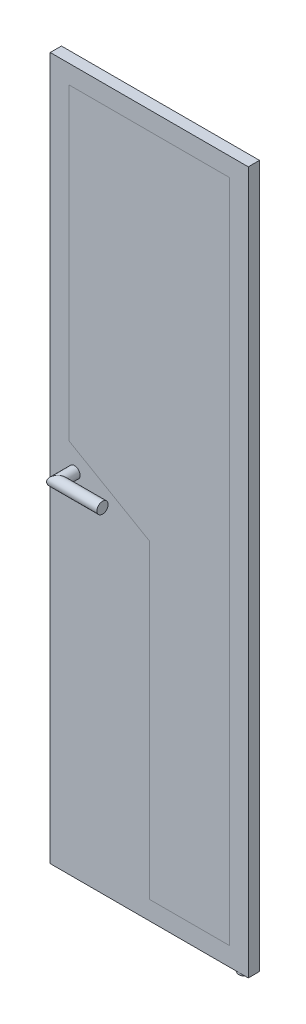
from build123d import *

# Parameters (mm, degrees)
SKETCH1_W           = 530
SKETCH1_H           = 1880
BOSS_EXTRUDE1_DEPTH = 15
SKETCH2_R           = 15
BOSS_EXTRUDE2_DEPTH = 5
BOSS_EXTRUDE3_DEPTH = 15
SKETCH3_R           = 15


with BuildPart() as part:
    # Sketch1 → Boss-Extrude1 (new, symmetric)
    with BuildSketch(Plane.XY):
        Rectangle(SKETCH1_W, SKETCH1_H)
        Polygon((-215, 65), (-215, 890), (215, 890), (215, -890), (0, -890), (0, -59.130307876), align=None, mode=Mode.SUBTRACT)
    extrude(amount=BOSS_EXTRUDE1_DEPTH, both=True)

    # Sketch2 → Boss-Extrude2 (add, symmetric)
    with BuildSketch(Plane.XZ.offset(940)):
        with Locations(Location((240, 0, 0), (0, 0, 270))):
            Circle(SKETCH2_R)
    extrude(amount=BOSS_EXTRUDE2_DEPTH, both=True)

    # Sweep1: sweep along a path in Sketch4
    with BuildLine(Plane(origin=(0, 0, 0), x_dir=(1, 0, 0), z_dir=(0, 1, 0))) as sweep1_path:
        Line((-80, 60), (-200, 60))
        Line((-200, 60), (-200, -60))
        Line((-200, -60), (-80, -60))
    # Sketch3 → Sweep1 (sweep)
    with BuildSketch(Plane.XY):
        with Locations((-200, 0)):
            Circle(SKETCH3_R)
    sweep(path=sweep1_path.line, transition=Transition.RIGHT)


with BuildPart() as body_2:
    # Sketch1_2 → Boss-Extrude3 (new, symmetric)
    with BuildSketch(Plane.XY):
        Polygon((-215, 65), (0, -59.130307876), (0, -890), (215, -890), (215, 890), (-215, 890), align=None)
    extrude(amount=BOSS_EXTRUDE3_DEPTH, both=True)


solid = Compound([part.part, body_2.part])
